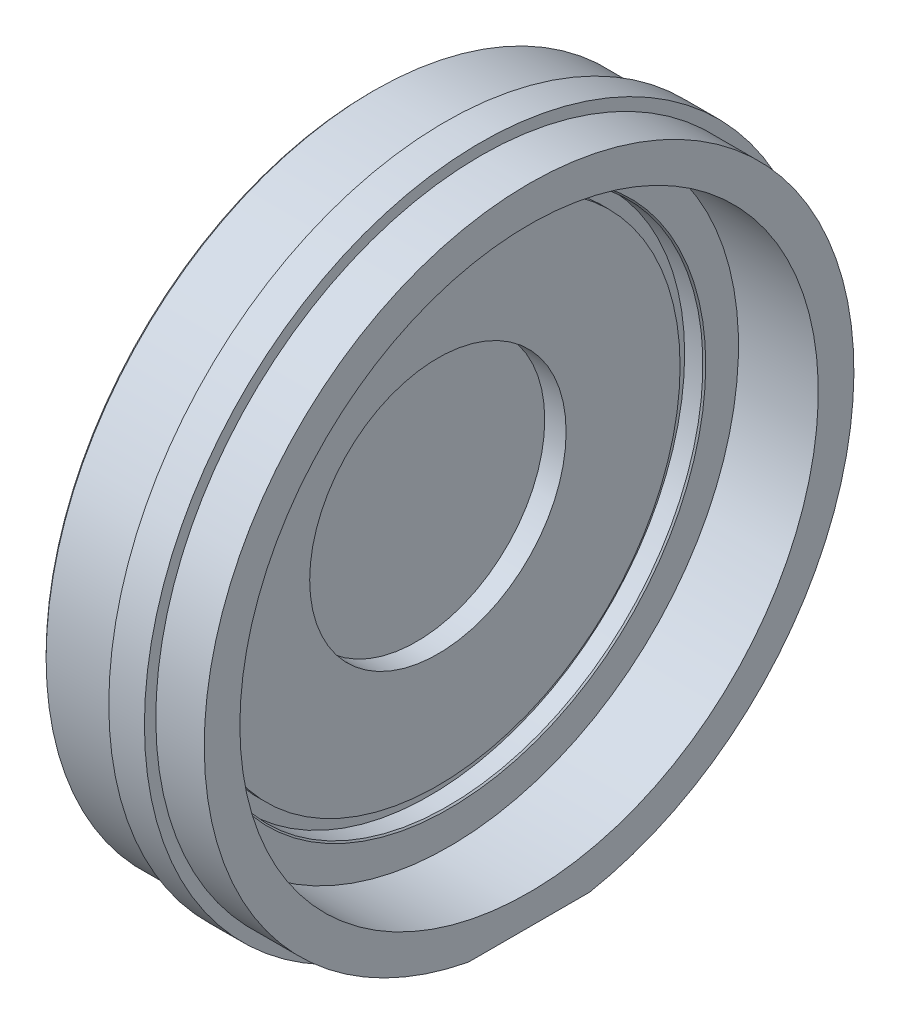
ISO-10303-21;
HEADER;
FILE_DESCRIPTION(('STEP AP214'),'2;1');
FILE_NAME('part.step','',(''),(''),'','','');
FILE_SCHEMA(('AUTOMOTIVE_DESIGN { 1 0 10303 214 1 1 1 1 }'));
ENDSEC;
DATA;
#1=APPLICATION_CONTEXT('core data for automotive mechanical design processes');
#2=APPLICATION_PROTOCOL_DEFINITION('international standard','automotive_design',2000,#1);
#3=PRODUCT_CONTEXT('',#1,'mechanical');
#4=PRODUCT('Part','Part','',(#3));
#5=PRODUCT_RELATED_PRODUCT_CATEGORY('part','',(#4));
#6=PRODUCT_DEFINITION_FORMATION('','',#4);
#7=PRODUCT_DEFINITION_CONTEXT('part definition',#1,'design');
#8=PRODUCT_DEFINITION('design','',#6,#7);
#9=PRODUCT_DEFINITION_SHAPE('','',#8);
#10=(LENGTH_UNIT() NAMED_UNIT(*) SI_UNIT(.MILLI.,.METRE.));
#11=(NAMED_UNIT(*) PLANE_ANGLE_UNIT() SI_UNIT($,.RADIAN.));
#12=(NAMED_UNIT(*) SI_UNIT($,.STERADIAN.) SOLID_ANGLE_UNIT());
#13=UNCERTAINTY_MEASURE_WITH_UNIT(LENGTH_MEASURE(1.E-05),#10,'distance_accuracy_value','');
#14=(GEOMETRIC_REPRESENTATION_CONTEXT(3) GLOBAL_UNCERTAINTY_ASSIGNED_CONTEXT((#13)) GLOBAL_UNIT_ASSIGNED_CONTEXT((#10,
#11,#12)) REPRESENTATION_CONTEXT('',''));
#15=CARTESIAN_POINT('',(0.,0.,0.));
#16=DIRECTION('',(0.,0.,1.));
#17=DIRECTION('',(1.,0.,0.));
#18=AXIS2_PLACEMENT_3D('',#15,#16,#17);
#19=CARTESIAN_POINT('',(2.49999999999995,115.,0.));
#20=DIRECTION('',(1.,0.,0.));
#21=DIRECTION('',(0.,0.,-1.));
#22=AXIS2_PLACEMENT_3D('',#19,#20,#21);
#23=PLANE('',#22);
#24=CARTESIAN_POINT('',(2.49999999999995,0.,0.));
#25=DIRECTION('',(-1.,0.,0.));
#26=DIRECTION('',(0.,0.,1.));
#27=AXIS2_PLACEMENT_3D('',#24,#25,#26);
#28=CIRCLE('',#27,115.);
#29=CARTESIAN_POINT('',(2.49999999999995,0.,115.));
#30=VERTEX_POINT('',#29);
#31=EDGE_CURVE('E115',#30,#30,#28,.T.);
#32=ORIENTED_EDGE('',*,*,#31,.F.);
#33=EDGE_LOOP('',(#32));
#34=FACE_BOUND('',#33,.T.);
#35=DIRECTION('',(0.,-1.,0.));
#36=VECTOR('',#35,1.);
#37=CARTESIAN_POINT('',(2.49999999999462,-115.5,-4.99999999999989));
#38=LINE('',#37,#36);
#39=CARTESIAN_POINT('',(2.49999999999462,-115.5,-4.99999999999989));
#40=VERTEX_POINT('',#39);
#41=CARTESIAN_POINT('',(2.49999999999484,-117.894020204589,-4.99999999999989));
#42=VERTEX_POINT('',#41);
#43=EDGE_CURVE('E276',#40,#42,#38,.T.);
#44=ORIENTED_EDGE('',*,*,#43,.F.);
#45=DIRECTION('',(0.,0.,1.));
#46=VECTOR('',#45,1.);
#47=CARTESIAN_POINT('',(2.49999999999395,-115.5,5.00000000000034));
#48=LINE('',#47,#46);
#49=CARTESIAN_POINT('',(2.49999999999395,-115.5,5.00000000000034));
#50=VERTEX_POINT('',#49);
#51=EDGE_CURVE('E279',#40,#50,#48,.T.);
#52=ORIENTED_EDGE('',*,*,#51,.T.);
#53=DIRECTION('',(0.,-1.,0.));
#54=VECTOR('',#53,1.);
#55=CARTESIAN_POINT('',(2.49999999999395,-115.5,5.00000000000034));
#56=LINE('',#55,#54);
#57=CARTESIAN_POINT('',(2.49999999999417,-117.894020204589,5.00000000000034));
#58=VERTEX_POINT('',#57);
#59=EDGE_CURVE('E284',#50,#58,#56,.T.);
#60=ORIENTED_EDGE('',*,*,#59,.T.);
#61=CARTESIAN_POINT('',(2.49999999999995,0.,0.));
#62=DIRECTION('',(-1.,0.,0.));
#63=DIRECTION('',(0.,0.,1.));
#64=AXIS2_PLACEMENT_3D('',#61,#62,#63);
#65=CIRCLE('',#64,118.);
#66=EDGE_CURVE('E107',#58,#42,#65,.T.);
#67=ORIENTED_EDGE('',*,*,#66,.T.);
#68=EDGE_LOOP('',(#44,#52,#60,#67));
#69=FACE_BOUND('',#68,.T.);
#70=ADVANCED_FACE('F14',(#34,#69),#23,.F.);
#71=CARTESIAN_POINT('',(0.,0.,0.));
#72=DIRECTION('',(-1.,0.,0.));
#73=DIRECTION('',(0.,0.,1.));
#74=AXIS2_PLACEMENT_3D('',#71,#72,#73);
#75=CYLINDRICAL_SURFACE('',#74,118.);
#76=CARTESIAN_POINT('',(14.9999999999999,0.,0.));
#77=DIRECTION('',(-1.,0.,0.));
#78=DIRECTION('',(0.,0.,1.));
#79=AXIS2_PLACEMENT_3D('',#76,#77,#78);
#80=CIRCLE('',#79,118.);
#81=CARTESIAN_POINT('',(14.9999999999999,0.,118.));
#82=VERTEX_POINT('',#81);
#83=EDGE_CURVE('E104',#82,#82,#80,.T.);
#84=ORIENTED_EDGE('',*,*,#83,.T.);
#85=EDGE_LOOP('',(#84));
#86=FACE_BOUND('',#85,.T.);
#87=DIRECTION('',(-1.,0.,0.));
#88=VECTOR('',#87,1.);
#89=CARTESIAN_POINT('',(-5.10702591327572E-12,-117.894020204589,-4.99999999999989));
#90=LINE('',#89,#88);
#91=CARTESIAN_POINT('',(3.49999999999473,-117.894020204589,-4.99999999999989));
#92=VERTEX_POINT('',#91);
#93=EDGE_CURVE('E133',#42,#92,#90,.F.);
#94=ORIENTED_EDGE('',*,*,#93,.F.);
#95=ORIENTED_EDGE('',*,*,#66,.F.);
#96=DIRECTION('',(-1.,0.,0.));
#97=VECTOR('',#96,1.);
#98=CARTESIAN_POINT('',(-5.77315972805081E-12,-117.894020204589,5.00000000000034));
#99=LINE('',#98,#97);
#100=CARTESIAN_POINT('',(3.49999999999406,-117.894020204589,5.00000000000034));
#101=VERTEX_POINT('',#100);
#102=EDGE_CURVE('E124',#101,#58,#99,.T.);
#103=ORIENTED_EDGE('',*,*,#102,.F.);
#104=CARTESIAN_POINT('',(3.49999999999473,-117.894020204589,-4.99999999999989));
#105=CARTESIAN_POINT('',(3.64055955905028,-117.894017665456,-5.00001518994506));
#106=CARTESIAN_POINT('',(3.78111685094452,-117.894271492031,-4.99407354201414));
#107=CARTESIAN_POINT('',(4.0612246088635,-117.895273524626,-4.97038634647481));
#108=CARTESIAN_POINT('',(4.20077512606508,-117.896021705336,-4.9526414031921));
#109=CARTESIAN_POINT('',(4.47777916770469,-117.897993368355,-4.90547482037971));
#110=CARTESIAN_POINT('',(4.61523416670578,-117.899216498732,-4.87606182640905));
#111=CARTESIAN_POINT('',(4.88717517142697,-117.90210252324,-4.80577413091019));
#112=CARTESIAN_POINT('',(5.02166121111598,-117.903765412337,-4.76489956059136));
#113=CARTESIAN_POINT('',(5.28674693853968,-117.907484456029,-4.67196620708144));
#114=CARTESIAN_POINT('',(5.41734556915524,-117.909540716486,-4.61990441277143));
#115=CARTESIAN_POINT('',(5.67373937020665,-117.913988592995,-4.50495306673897));
#116=CARTESIAN_POINT('',(5.79953274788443,-117.916380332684,-4.44205952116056));
#117=CARTESIAN_POINT('',(6.04530439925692,-117.921429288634,-4.30594328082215));
#118=CARTESIAN_POINT('',(6.16528584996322,-117.92408635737,-4.23272631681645));
#119=CARTESIAN_POINT('',(6.39870137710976,-117.929592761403,-4.07642804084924));
#120=CARTESIAN_POINT('',(6.51213301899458,-117.93244216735,-3.99334309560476));
#121=CARTESIAN_POINT('',(6.7316204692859,-117.938252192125,-3.81790151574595));
#122=CARTESIAN_POINT('',(6.8376747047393,-117.941212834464,-3.72554291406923));
#123=CARTESIAN_POINT('',(7.04166682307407,-117.947161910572,-3.532188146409));
#124=CARTESIAN_POINT('',(7.13960169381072,-117.950150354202,-3.43118880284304));
#125=CARTESIAN_POINT('',(7.32659610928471,-117.956068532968,-3.22132127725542));
#126=CARTESIAN_POINT('',(7.41565757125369,-117.958998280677,-3.11245480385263));
#127=CARTESIAN_POINT('',(7.58432830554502,-117.964717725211,-2.8875640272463));
#128=CARTESIAN_POINT('',(7.6639340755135,-117.967507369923,-2.77153709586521));
#129=CARTESIAN_POINT('',(7.81308651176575,-117.972866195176,-2.5331892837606));
#130=CARTESIAN_POINT('',(7.88263353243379,-117.975435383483,-2.41086862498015));
#131=CARTESIAN_POINT('',(8.01120050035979,-117.980281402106,-2.16075211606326));
#132=CARTESIAN_POINT('',(8.07021655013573,-117.982558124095,-2.0329542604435));
#133=CARTESIAN_POINT('',(8.1772453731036,-117.986752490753,-1.7728896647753));
#134=CARTESIAN_POINT('',(8.22526292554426,-117.988670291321,-1.64062489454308));
#135=CARTESIAN_POINT('',(8.31000119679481,-117.992094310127,-1.37246954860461));
#136=CARTESIAN_POINT('',(8.34671775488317,-117.993600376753,-1.23657765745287));
#137=CARTESIAN_POINT('',(8.40853534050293,-117.996155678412,-0.962294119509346));
#138=CARTESIAN_POINT('',(8.43364731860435,-117.997205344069,-0.823904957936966));
#139=CARTESIAN_POINT('',(8.47214463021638,-117.998821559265,-0.545505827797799));
#140=CARTESIAN_POINT('',(8.48552588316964,-117.999387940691,-0.405495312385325));
#141=CARTESIAN_POINT('',(8.50783931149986,-118.000330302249,0.0154889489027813));
#142=CARTESIAN_POINT('',(8.49900634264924,-117.999952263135,0.297705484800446));
#143=CARTESIAN_POINT('',(8.4504214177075,-117.997909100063,0.716377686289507));
#144=CARTESIAN_POINT('',(8.42832903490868,-117.996981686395,0.855187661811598));
#145=CARTESIAN_POINT('',(8.37254910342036,-117.99466480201,1.13045776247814));
#146=CARTESIAN_POINT('',(8.33886558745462,-117.993275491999,1.26691868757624));
#147=CARTESIAN_POINT('',(8.26012180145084,-117.990072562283,1.53655079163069));
#148=CARTESIAN_POINT('',(8.21505749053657,-117.988258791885,1.66972078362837));
#149=CARTESIAN_POINT('',(8.1138996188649,-117.984259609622,1.93174548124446));
#150=CARTESIAN_POINT('',(8.05781011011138,-117.982074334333,2.06060175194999));
#151=CARTESIAN_POINT('',(7.93494577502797,-117.977391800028,2.31322284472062));
#152=CARTESIAN_POINT('',(7.8681633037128,-117.974894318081,2.43698394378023));
#153=CARTESIAN_POINT('',(7.72444364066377,-117.969660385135,2.67839540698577));
#154=CARTESIAN_POINT('',(7.64751019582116,-117.966924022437,2.7960480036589));
#155=CARTESIAN_POINT('',(7.48398911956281,-117.961288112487,3.02449483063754));
#156=CARTESIAN_POINT('',(7.39739836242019,-117.958388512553,3.13528682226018));
#157=CARTESIAN_POINT('',(7.21523107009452,-117.952510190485,3.34914631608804));
#158=CARTESIAN_POINT('',(7.11965785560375,-117.949531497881,3.45221664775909));
#159=CARTESIAN_POINT('',(6.9200736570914,-117.943575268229,3.65004920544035));
#160=CARTESIAN_POINT('',(6.81605414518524,-117.940597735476,3.74480282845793));
#161=CARTESIAN_POINT('',(6.60044039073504,-117.934732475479,3.92517747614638));
#162=CARTESIAN_POINT('',(6.48884895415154,-117.93184471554,4.01080185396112));
#163=CARTESIAN_POINT('',(6.25876941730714,-117.926237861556,4.1724055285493));
#164=CARTESIAN_POINT('',(6.140276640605,-117.923518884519,4.24837817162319));
#165=CARTESIAN_POINT('',(5.89735057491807,-117.918330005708,4.39004251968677));
#166=CARTESIAN_POINT('',(5.77291949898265,-117.915860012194,4.45573801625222));
#167=CARTESIAN_POINT('',(5.51883271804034,-117.911235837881,4.57647449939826));
#168=CARTESIAN_POINT('',(5.3891719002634,-117.909081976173,4.63150473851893));
#169=CARTESIAN_POINT('',(5.12571463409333,-117.905155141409,4.73041668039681));
#170=CARTESIAN_POINT('',(4.99191976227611,-117.903382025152,4.77430257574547));
#171=CARTESIAN_POINT('',(4.72125409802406,-117.900267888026,4.85059678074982));
#172=CARTESIAN_POINT('',(4.58438684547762,-117.898926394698,4.88301764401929));
#173=CARTESIAN_POINT('',(4.30845867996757,-117.896711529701,4.93620512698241));
#174=CARTESIAN_POINT('',(4.16939887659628,-117.895837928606,4.95697745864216));
#175=CARTESIAN_POINT('',(3.94169922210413,-117.894814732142,4.98123925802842));
#176=CARTESIAN_POINT('',(3.85342307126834,-117.894516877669,4.98827898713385));
#177=CARTESIAN_POINT('',(3.67676766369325,-117.894119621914,4.9976560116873));
#178=CARTESIAN_POINT('',(3.5883888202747,-117.894019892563,5.00000108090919));
#179=CARTESIAN_POINT('',(3.49999999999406,-117.894020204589,5.00000000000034));
#180=B_SPLINE_CURVE_WITH_KNOTS('',3,(#104,#105,#106,#107,#108,#109,#110,#111,#112,#113,#114,
#115,#116,#117,#118,#119,#120,#121,#122,#123,#124,#125,#126,#127,#128,#129,#130,#131,#132,#133,
#134,#135,#136,#137,#138,#139,#140,#141,#142,#143,#144,#145,#146,#147,#148,#149,#150,#151,#152,
#153,#154,#155,#156,#157,#158,#159,#160,#161,#162,#163,#164,#165,#166,#167,#168,#169,#170,#171,
#172,#173,#174,#175,#176,#177,#178,#179),.UNSPECIFIED.,.F.,.F.,(4,2,2,2,2,2,2,2,2,2,2,2,2,2,2,2,
2,2,2,2,2,2,2,2,2,2,2,2,2,2,2,2,2,2,2,2,2,4),(0.,0.421549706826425,0.84307783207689,
1.26429420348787,1.6855057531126,2.1068308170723,2.52831156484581,2.94955925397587,
3.37096252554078,3.79245537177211,4.21410389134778,4.63566110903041,5.05737398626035,
5.47907200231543,5.90092576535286,6.32259586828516,6.74442103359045,7.16584732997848,
7.58742016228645,8.42968456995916,8.85098972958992,9.27214845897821,9.69345693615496,
10.1146108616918,10.5360672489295,10.9573685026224,11.3788065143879,11.8000893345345,
12.2218029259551,12.6433610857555,13.065208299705,13.4868995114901,13.9090134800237,
14.3309684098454,14.7524598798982,15.1737444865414,15.4393000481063,15.7044155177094),.UNSPECIFIED.);
#181=EDGE_CURVE('E126',#92,#101,#180,.T.);
#182=ORIENTED_EDGE('',*,*,#181,.F.);
#183=EDGE_LOOP('',(#94,#95,#103,#182));
#184=FACE_BOUND('',#183,.T.);
#185=ADVANCED_FACE('F135',(#86,#184),#75,.T.);
#186=CARTESIAN_POINT('',(-23.5000000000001,115.,-3.06421554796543E-11));
#187=DIRECTION('',(1.,0.,0.));
#188=DIRECTION('',(0.,0.,-1.));
#189=AXIS2_PLACEMENT_3D('',#186,#187,#188);
#190=PLANE('',#189);
#191=CARTESIAN_POINT('',(-23.5000000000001,0.,0.));
#192=DIRECTION('',(1.,0.,0.));
#193=DIRECTION('',(0.,0.,-1.));
#194=AXIS2_PLACEMENT_3D('',#191,#192,#193);
#195=CIRCLE('',#194,114.);
#196=CARTESIAN_POINT('',(-23.5000000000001,0.,-114.));
#197=VERTEX_POINT('',#196);
#198=EDGE_CURVE('E390',#197,#197,#195,.F.);
#199=ORIENTED_EDGE('',*,*,#198,.T.);
#200=EDGE_LOOP('',(#199));
#201=FACE_BOUND('',#200,.T.);
#202=CARTESIAN_POINT('',(-23.5000000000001,99.9999999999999,-3.06421554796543E-11));
#203=DIRECTION('',(-1.,0.,0.));
#204=DIRECTION('',(0.,0.,1.));
#205=AXIS2_PLACEMENT_3D('',#202,#203,#204);
#206=CIRCLE('',#205,5.1);
#207=CARTESIAN_POINT('',(-23.5000000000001,99.9999999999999,5.09999999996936));
#208=VERTEX_POINT('',#207);
#209=EDGE_CURVE('E294',#208,#208,#206,.T.);
#210=ORIENTED_EDGE('',*,*,#209,.F.);
#211=EDGE_LOOP('',(#210));
#212=FACE_BOUND('',#211,.T.);
#213=CARTESIAN_POINT('',(-23.4999999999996,49.9999999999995,86.6025403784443));
#214=DIRECTION('',(-1.,0.,0.));
#215=DIRECTION('',(0.,0.,1.));
#216=AXIS2_PLACEMENT_3D('',#213,#214,#215);
#217=CIRCLE('',#216,5.1);
#218=CARTESIAN_POINT('',(-23.4999999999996,49.9999999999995,91.7025403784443));
#219=VERTEX_POINT('',#218);
#220=EDGE_CURVE('E300',#219,#219,#217,.T.);
#221=ORIENTED_EDGE('',*,*,#220,.F.);
#222=EDGE_LOOP('',(#221));
#223=FACE_BOUND('',#222,.T.);
#224=CARTESIAN_POINT('',(-23.5000000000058,-50.0000000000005,86.6025403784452));
#225=DIRECTION('',(-1.,0.,0.));
#226=DIRECTION('',(0.,0.,1.));
#227=AXIS2_PLACEMENT_3D('',#224,#225,#226);
#228=CIRCLE('',#227,5.1);
#229=CARTESIAN_POINT('',(-23.5000000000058,-50.0000000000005,91.7025403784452));
#230=VERTEX_POINT('',#229);
#231=EDGE_CURVE('E306',#230,#230,#228,.T.);
#232=ORIENTED_EDGE('',*,*,#231,.F.);
#233=EDGE_LOOP('',(#232));
#234=FACE_BOUND('',#233,.T.);
#235=CARTESIAN_POINT('',(-23.4999999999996,50.,-86.6025403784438));
#236=DIRECTION('',(-1.,0.,0.));
#237=DIRECTION('',(0.,0.,1.));
#238=AXIS2_PLACEMENT_3D('',#235,#236,#237);
#239=CIRCLE('',#238,5.1);
#240=CARTESIAN_POINT('',(-23.4999999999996,50.,-81.5025403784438));
#241=VERTEX_POINT('',#240);
#242=EDGE_CURVE('E312',#241,#241,#239,.T.);
#243=ORIENTED_EDGE('',*,*,#242,.F.);
#244=EDGE_LOOP('',(#243));
#245=FACE_BOUND('',#244,.T.);
#246=CARTESIAN_POINT('',(-23.5000000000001,-50.,-86.6025403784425));
#247=DIRECTION('',(-1.,0.,0.));
#248=DIRECTION('',(0.,0.,1.));
#249=AXIS2_PLACEMENT_3D('',#246,#247,#248);
#250=CIRCLE('',#249,5.1);
#251=CARTESIAN_POINT('',(-23.5000000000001,-50.,-81.5025403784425));
#252=VERTEX_POINT('',#251);
#253=EDGE_CURVE('E318',#252,#252,#250,.T.);
#254=ORIENTED_EDGE('',*,*,#253,.F.);
#255=EDGE_LOOP('',(#254));
#256=FACE_BOUND('',#255,.T.);
#257=CARTESIAN_POINT('',(-23.5000000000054,-100.,1.33226762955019E-12));
#258=DIRECTION('',(-1.,0.,0.));
#259=DIRECTION('',(0.,0.,1.));
#260=AXIS2_PLACEMENT_3D('',#257,#258,#259);
#261=CIRCLE('',#260,5.1);
#262=CARTESIAN_POINT('',(-23.5000000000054,-100.,5.10000000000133));
#263=VERTEX_POINT('',#262);
#264=EDGE_CURVE('E324',#263,#263,#261,.T.);
#265=ORIENTED_EDGE('',*,*,#264,.F.);
#266=EDGE_LOOP('',(#265));
#267=FACE_BOUND('',#266,.T.);
#268=CARTESIAN_POINT('',(-23.5000000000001,-3.4781205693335E-13,100.));
#269=DIRECTION('',(-1.,0.,0.));
#270=DIRECTION('',(0.,0.,1.));
#271=AXIS2_PLACEMENT_3D('',#268,#269,#270);
#272=CIRCLE('',#271,7.);
#273=CARTESIAN_POINT('',(-23.5000000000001,-3.4781205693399E-13,107.));
#274=VERTEX_POINT('',#273);
#275=EDGE_CURVE('E333',#274,#274,#272,.T.);
#276=ORIENTED_EDGE('',*,*,#275,.F.);
#277=EDGE_LOOP('',(#276));
#278=FACE_BOUND('',#277,.T.);
#279=CARTESIAN_POINT('',(-23.5000000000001,0.,0.));
#280=DIRECTION('',(1.,0.,0.));
#281=DIRECTION('',(0.,0.,-1.));
#282=AXIS2_PLACEMENT_3D('',#279,#280,#281);
#283=CIRCLE('',#282,63.5);
#284=CARTESIAN_POINT('',(-23.5000000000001,0.,-63.5));
#285=VERTEX_POINT('',#284);
#286=EDGE_CURVE('E121',#285,#285,#283,.T.);
#287=ORIENTED_EDGE('',*,*,#286,.T.);
#288=EDGE_LOOP('',(#287));
#289=FACE_BOUND('',#288,.T.);
#290=ADVANCED_FACE('F16',(#201,#212,#223,#234,#245,#256,#267,#278,#289),#190,.F.);
#291=CARTESIAN_POINT('',(0.,0.,0.));
#292=DIRECTION('',(-1.,0.,0.));
#293=DIRECTION('',(0.,0.,1.));
#294=AXIS2_PLACEMENT_3D('',#291,#292,#293);
#295=CYLINDRICAL_SURFACE('',#294,115.);
#296=CARTESIAN_POINT('',(-22.5,0.,0.));
#297=DIRECTION('',(1.,0.,0.));
#298=DIRECTION('',(0.,0.,-1.));
#299=AXIS2_PLACEMENT_3D('',#296,#297,#298);
#300=CIRCLE('',#299,115.);
#301=CARTESIAN_POINT('',(-22.5,0.,-115.));
#302=VERTEX_POINT('',#301);
#303=EDGE_CURVE('E392',#302,#302,#300,.T.);
#304=ORIENTED_EDGE('',*,*,#303,.T.);
#305=EDGE_LOOP('',(#304));
#306=FACE_BOUND('',#305,.T.);
#307=ORIENTED_EDGE('',*,*,#31,.T.);
#308=EDGE_LOOP('',(#307));
#309=FACE_BOUND('',#308,.T.);
#310=ADVANCED_FACE('F258',(#306,#309),#295,.T.);
#311=CARTESIAN_POINT('',(15.0000000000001,118.,0.));
#312=DIRECTION('',(-1.,0.,0.));
#313=DIRECTION('',(0.,0.,1.));
#314=AXIS2_PLACEMENT_3D('',#311,#312,#313);
#315=PLANE('',#314);
#316=ORIENTED_EDGE('',*,*,#83,.F.);
#317=EDGE_LOOP('',(#316));
#318=FACE_BOUND('',#317,.T.);
#319=DIRECTION('',(0.,0.,1.));
#320=VECTOR('',#319,1.);
#321=CARTESIAN_POINT('',(15.0000000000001,-111.999999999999,25.0000000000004));
#322=LINE('',#321,#320);
#323=CARTESIAN_POINT('',(15.0000000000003,-111.999999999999,-21.2602916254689));
#324=VERTEX_POINT('',#323);
#325=CARTESIAN_POINT('',(15.0000000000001,-112.,21.2602916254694));
#326=VERTEX_POINT('',#325);
#327=EDGE_CURVE('E86',#324,#326,#322,.T.);
#328=ORIENTED_EDGE('',*,*,#327,.T.);
#329=CARTESIAN_POINT('',(14.9999999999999,0.,0.));
#330=DIRECTION('',(-1.,0.,0.));
#331=DIRECTION('',(0.,0.,1.));
#332=AXIS2_PLACEMENT_3D('',#329,#330,#331);
#333=CIRCLE('',#332,114.);
#334=EDGE_CURVE('E98',#326,#324,#333,.T.);
#335=ORIENTED_EDGE('',*,*,#334,.T.);
#336=EDGE_LOOP('',(#328,#335));
#337=FACE_BOUND('',#336,.T.);
#338=ADVANCED_FACE('F103',(#318,#337),#315,.F.);
#339=CARTESIAN_POINT('',(0.,0.,0.));
#340=DIRECTION('',(-1.,0.,0.));
#341=DIRECTION('',(0.,0.,1.));
#342=AXIS2_PLACEMENT_3D('',#339,#340,#341);
#343=CYLINDRICAL_SURFACE('',#342,114.);
#344=CARTESIAN_POINT('',(32.,0.,0.));
#345=DIRECTION('',(-1.,0.,0.));
#346=DIRECTION('',(0.,0.,1.));
#347=AXIS2_PLACEMENT_3D('',#344,#345,#346);
#348=CIRCLE('',#347,114.);
#349=CARTESIAN_POINT('',(32.,-112.,21.2602916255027));
#350=VERTEX_POINT('',#349);
#351=CARTESIAN_POINT('',(32.0000000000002,-111.999999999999,-21.2602916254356));
#352=VERTEX_POINT('',#351);
#353=EDGE_CURVE('E100',#350,#352,#348,.T.);
#354=ORIENTED_EDGE('',*,*,#353,.T.);
#355=DIRECTION('',(-1.,0.,0.));
#356=VECTOR('',#355,1.);
#357=CARTESIAN_POINT('',(4.44089209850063E-13,-112.,-21.2602916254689));
#358=LINE('',#357,#356);
#359=EDGE_CURVE('E29',#352,#324,#358,.T.);
#360=ORIENTED_EDGE('',*,*,#359,.T.);
#361=ORIENTED_EDGE('',*,*,#334,.F.);
#362=DIRECTION('',(-1.,0.,0.));
#363=VECTOR('',#362,1.);
#364=CARTESIAN_POINT('',(0.,-112.,21.2602916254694));
#365=LINE('',#364,#363);
#366=EDGE_CURVE('E89',#326,#350,#365,.F.);
#367=ORIENTED_EDGE('',*,*,#366,.T.);
#368=EDGE_LOOP('',(#354,#360,#361,#367));
#369=FACE_BOUND('',#368,.T.);
#370=ADVANCED_FACE('F97',(#369),#343,.T.);
#371=CARTESIAN_POINT('',(32.,101.500000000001,0.));
#372=DIRECTION('',(-1.,0.,0.));
#373=DIRECTION('',(0.,0.,1.));
#374=AXIS2_PLACEMENT_3D('',#371,#372,#373);
#375=PLANE('',#374);
#376=ORIENTED_EDGE('',*,*,#353,.F.);
#377=DIRECTION('',(0.,0.,-1.));
#378=VECTOR('',#377,1.);
#379=CARTESIAN_POINT('',(31.9999999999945,-111.999999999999,3.37507799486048E-11));
#380=LINE('',#379,#378);
#381=EDGE_CURVE('E396',#350,#352,#380,.T.);
#382=ORIENTED_EDGE('',*,*,#381,.T.);
#383=EDGE_LOOP('',(#376,#382));
#384=FACE_BOUND('',#383,.T.);
#385=CARTESIAN_POINT('',(32.,0.,0.));
#386=DIRECTION('',(-1.,0.,0.));
#387=DIRECTION('',(0.,0.,1.));
#388=AXIS2_PLACEMENT_3D('',#385,#386,#387);
#389=CIRCLE('',#388,101.5);
#390=CARTESIAN_POINT('',(32.,0.,101.5));
#391=VERTEX_POINT('',#390);
#392=EDGE_CURVE('E109',#391,#391,#389,.T.);
#393=ORIENTED_EDGE('',*,*,#392,.T.);
#394=EDGE_LOOP('',(#393));
#395=FACE_BOUND('',#394,.T.);
#396=ADVANCED_FACE('F251',(#384,#395),#375,.F.);
#397=CARTESIAN_POINT('',(0.,0.,0.));
#398=DIRECTION('',(-1.,0.,0.));
#399=DIRECTION('',(0.,0.,1.));
#400=AXIS2_PLACEMENT_3D('',#397,#398,#399);
#401=CYLINDRICAL_SURFACE('',#400,101.5);
#402=ORIENTED_EDGE('',*,*,#392,.F.);
#403=EDGE_LOOP('',(#402));
#404=FACE_BOUND('',#403,.T.);
#405=CARTESIAN_POINT('',(4.,0.,0.));
#406=DIRECTION('',(-1.,0.,0.));
#407=DIRECTION('',(0.,0.,1.));
#408=AXIS2_PLACEMENT_3D('',#405,#406,#407);
#409=CIRCLE('',#408,101.5);
#410=CARTESIAN_POINT('',(4.,0.,101.5));
#411=VERTEX_POINT('',#410);
#412=EDGE_CURVE('E351',#411,#411,#409,.T.);
#413=ORIENTED_EDGE('',*,*,#412,.T.);
#414=EDGE_LOOP('',(#413));
#415=FACE_BOUND('',#414,.T.);
#416=ADVANCED_FACE('F247',(#404,#415),#401,.F.);
#417=CARTESIAN_POINT('',(4.,89.5,3.37507799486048E-11));
#418=DIRECTION('',(-1.,0.,0.));
#419=DIRECTION('',(0.,0.,1.));
#420=AXIS2_PLACEMENT_3D('',#417,#418,#419);
#421=PLANE('',#420);
#422=CARTESIAN_POINT('',(4.,0.,0.));
#423=DIRECTION('',(-1.,0.,0.));
#424=DIRECTION('',(0.,0.,1.));
#425=AXIS2_PLACEMENT_3D('',#422,#423,#424);
#426=CIRCLE('',#425,90.);
#427=CARTESIAN_POINT('',(4.,0.,90.));
#428=VERTEX_POINT('',#427);
#429=EDGE_CURVE('E22',#428,#428,#426,.T.);
#430=ORIENTED_EDGE('',*,*,#429,.T.);
#431=EDGE_LOOP('',(#430));
#432=FACE_BOUND('',#431,.T.);
#433=ORIENTED_EDGE('',*,*,#412,.F.);
#434=EDGE_LOOP('',(#433));
#435=FACE_BOUND('',#434,.T.);
#436=ADVANCED_FACE('F243',(#432,#435),#421,.F.);
#437=CARTESIAN_POINT('',(0.,0.,0.));
#438=DIRECTION('',(-1.,0.,0.));
#439=DIRECTION('',(0.,0.,1.));
#440=AXIS2_PLACEMENT_3D('',#437,#438,#439);
#441=CYLINDRICAL_SURFACE('',#440,89.5);
#442=CARTESIAN_POINT('',(3.50000000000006,0.,0.));
#443=DIRECTION('',(-1.,0.,0.));
#444=DIRECTION('',(0.,0.,1.));
#445=AXIS2_PLACEMENT_3D('',#442,#443,#444);
#446=CIRCLE('',#445,89.5);
#447=CARTESIAN_POINT('',(3.50000000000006,0.,89.5));
#448=VERTEX_POINT('',#447);
#449=EDGE_CURVE('E9',#448,#448,#446,.F.);
#450=ORIENTED_EDGE('',*,*,#449,.T.);
#451=EDGE_LOOP('',(#450));
#452=FACE_BOUND('',#451,.T.);
#453=CARTESIAN_POINT('',(-2.8999999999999,0.,0.));
#454=DIRECTION('',(1.,0.,0.));
#455=DIRECTION('',(0.,0.,-1.));
#456=AXIS2_PLACEMENT_3D('',#453,#454,#455);
#457=CIRCLE('',#456,89.5);
#458=CARTESIAN_POINT('',(-2.8999999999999,0.,-89.5));
#459=VERTEX_POINT('',#458);
#460=EDGE_CURVE('E93',#459,#459,#457,.T.);
#461=ORIENTED_EDGE('',*,*,#460,.F.);
#462=EDGE_LOOP('',(#461));
#463=FACE_BOUND('',#462,.T.);
#464=ADVANCED_FACE('F226',(#452,#463),#441,.F.);
#465=CARTESIAN_POINT('',(-12.9999999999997,49.9999999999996,0.));
#466=DIRECTION('',(1.,0.,0.));
#467=DIRECTION('',(0.,0.,-1.));
#468=AXIS2_PLACEMENT_3D('',#465,#466,#467);
#469=PLANE('',#468);
#470=CARTESIAN_POINT('',(-12.9999999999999,0.,0.));
#471=DIRECTION('',(-1.,0.,0.));
#472=DIRECTION('',(0.,0.,1.));
#473=AXIS2_PLACEMENT_3D('',#470,#471,#472);
#474=CIRCLE('',#473,50.);
#475=CARTESIAN_POINT('',(-12.9999999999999,0.,50.));
#476=VERTEX_POINT('',#475);
#477=EDGE_CURVE('E342',#476,#476,#474,.T.);
#478=ORIENTED_EDGE('',*,*,#477,.T.);
#479=EDGE_LOOP('',(#478));
#480=FACE_BOUND('',#479,.T.);
#481=ADVANCED_FACE('F222',(#480),#469,.F.);
#482=CARTESIAN_POINT('',(0.,0.,0.));
#483=DIRECTION('',(-1.,0.,0.));
#484=DIRECTION('',(0.,0.,1.));
#485=AXIS2_PLACEMENT_3D('',#482,#483,#484);
#486=CYLINDRICAL_SURFACE('',#485,50.);
#487=ORIENTED_EDGE('',*,*,#477,.F.);
#488=EDGE_LOOP('',(#487));
#489=FACE_BOUND('',#488,.T.);
#490=CARTESIAN_POINT('',(-13.5000000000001,0.,0.));
#491=DIRECTION('',(-1.,0.,0.));
#492=DIRECTION('',(0.,0.,1.));
#493=AXIS2_PLACEMENT_3D('',#490,#491,#492);
#494=CIRCLE('',#493,50.);
#495=CARTESIAN_POINT('',(-13.5000000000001,0.,50.));
#496=VERTEX_POINT('',#495);
#497=EDGE_CURVE('E339',#496,#496,#494,.T.);
#498=ORIENTED_EDGE('',*,*,#497,.T.);
#499=EDGE_LOOP('',(#498));
#500=FACE_BOUND('',#499,.T.);
#501=ADVANCED_FACE('F218',(#489,#500),#486,.F.);
#502=CARTESIAN_POINT('',(-13.4999999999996,62.4999999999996,1.33226762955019E-12));
#503=DIRECTION('',(1.,0.,0.));
#504=DIRECTION('',(0.,0.,-1.));
#505=AXIS2_PLACEMENT_3D('',#502,#503,#504);
#506=PLANE('',#505);
#507=ORIENTED_EDGE('',*,*,#497,.F.);
#508=EDGE_LOOP('',(#507));
#509=FACE_BOUND('',#508,.T.);
#510=CARTESIAN_POINT('',(-13.5000000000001,0.,0.));
#511=DIRECTION('',(-1.,0.,0.));
#512=DIRECTION('',(0.,0.,1.));
#513=AXIS2_PLACEMENT_3D('',#510,#511,#512);
#514=CIRCLE('',#513,62.5);
#515=CARTESIAN_POINT('',(-13.5000000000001,0.,62.5));
#516=VERTEX_POINT('',#515);
#517=EDGE_CURVE('E336',#516,#516,#514,.T.);
#518=ORIENTED_EDGE('',*,*,#517,.T.);
#519=EDGE_LOOP('',(#518));
#520=FACE_BOUND('',#519,.T.);
#521=ADVANCED_FACE('F214',(#509,#520),#506,.F.);
#522=CARTESIAN_POINT('',(0.,0.,0.));
#523=DIRECTION('',(-1.,0.,0.));
#524=DIRECTION('',(0.,0.,1.));
#525=AXIS2_PLACEMENT_3D('',#522,#523,#524);
#526=CYLINDRICAL_SURFACE('',#525,62.5);
#527=CARTESIAN_POINT('',(-22.5,0.,0.));
#528=DIRECTION('',(1.,0.,0.));
#529=DIRECTION('',(0.,0.,-1.));
#530=AXIS2_PLACEMENT_3D('',#527,#528,#529);
#531=CIRCLE('',#530,62.5);
#532=CARTESIAN_POINT('',(-22.5,0.,-62.5));
#533=VERTEX_POINT('',#532);
#534=EDGE_CURVE('E118',#533,#533,#531,.F.);
#535=ORIENTED_EDGE('',*,*,#534,.T.);
#536=EDGE_LOOP('',(#535));
#537=FACE_BOUND('',#536,.T.);
#538=ORIENTED_EDGE('',*,*,#517,.F.);
#539=EDGE_LOOP('',(#538));
#540=FACE_BOUND('',#539,.T.);
#541=ADVANCED_FACE('F210',(#537,#540),#526,.F.);
#542=CARTESIAN_POINT('',(-22.5,0.,0.));
#543=DIRECTION('',(-1.,0.,0.));
#544=DIRECTION('',(0.,0.,1.));
#545=AXIS2_PLACEMENT_3D('',#542,#543,#544);
#546=CONICAL_SURFACE('',#545,62.5,0.785398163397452);
#547=ORIENTED_EDGE('',*,*,#286,.F.);
#548=EDGE_LOOP('',(#547));
#549=FACE_BOUND('',#548,.T.);
#550=ORIENTED_EDGE('',*,*,#534,.F.);
#551=EDGE_LOOP('',(#550));
#552=FACE_BOUND('',#551,.T.);
#553=ADVANCED_FACE('F206',(#549,#552),#546,.F.);
#554=CARTESIAN_POINT('',(-23.5000000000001,-3.4781205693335E-13,100.));
#555=DIRECTION('',(-1.,0.,0.));
#556=DIRECTION('',(0.,0.,1.));
#557=AXIS2_PLACEMENT_3D('',#554,#555,#556);
#558=CONICAL_SURFACE('',#557,7.,0.785398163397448);
#559=CARTESIAN_POINT('',(-22.5,-3.49113099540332E-13,100.));
#560=DIRECTION('',(-1.,0.,0.));
#561=DIRECTION('',(0.,0.,1.));
#562=AXIS2_PLACEMENT_3D('',#559,#560,#561);
#563=CIRCLE('',#562,6.);
#564=CARTESIAN_POINT('',(-22.5,-3.49113099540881E-13,106.));
#565=VERTEX_POINT('',#564);
#566=EDGE_CURVE('E330',#565,#565,#563,.T.);
#567=ORIENTED_EDGE('',*,*,#566,.F.);
#568=EDGE_LOOP('',(#567));
#569=FACE_BOUND('',#568,.T.);
#570=ORIENTED_EDGE('',*,*,#275,.T.);
#571=EDGE_LOOP('',(#570));
#572=FACE_BOUND('',#571,.T.);
#573=ADVANCED_FACE('F202',(#569,#572),#558,.F.);
#574=CARTESIAN_POINT('',(-23.5000000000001,-3.4781205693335E-13,100.));
#575=DIRECTION('',(-1.,0.,0.));
#576=DIRECTION('',(0.,0.,1.));
#577=AXIS2_PLACEMENT_3D('',#574,#575,#576);
#578=CYLINDRICAL_SURFACE('',#577,6.);
#579=CARTESIAN_POINT('',(-3.50000000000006,-3.51715184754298E-13,100.));
#580=DIRECTION('',(-1.,0.,0.));
#581=DIRECTION('',(0.,0.,1.));
#582=AXIS2_PLACEMENT_3D('',#579,#580,#581);
#583=CIRCLE('',#582,6.);
#584=CARTESIAN_POINT('',(-3.50000000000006,-3.51715184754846E-13,106.));
#585=VERTEX_POINT('',#584);
#586=EDGE_CURVE('E327',#585,#585,#583,.T.);
#587=ORIENTED_EDGE('',*,*,#586,.F.);
#588=EDGE_LOOP('',(#587));
#589=FACE_BOUND('',#588,.T.);
#590=ORIENTED_EDGE('',*,*,#566,.T.);
#591=EDGE_LOOP('',(#590));
#592=FACE_BOUND('',#591,.T.);
#593=ADVANCED_FACE('F198',(#589,#592),#578,.F.);
#594=CARTESIAN_POINT('',(-3.50000000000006,-3.51715184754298E-13,100.));
#595=DIRECTION('',(-1.,0.,0.));
#596=DIRECTION('',(0.,0.,1.));
#597=AXIS2_PLACEMENT_3D('',#594,#595,#596);
#598=CONICAL_SURFACE('',#597,6.,1.02974425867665);
#599=CARTESIAN_POINT('',(0.105163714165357,-3.54317269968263E-13,100.));
#600=VERTEX_POINT('',#599);
#601=VERTEX_LOOP('',#600);
#602=FACE_BOUND('',#601,.T.);
#603=ORIENTED_EDGE('',*,*,#586,.T.);
#604=EDGE_LOOP('',(#603));
#605=FACE_BOUND('',#604,.T.);
#606=ADVANCED_FACE('F194',(#602,#605),#598,.F.);
#607=CARTESIAN_POINT('',(-23.5000000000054,-100.,1.33226762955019E-12));
#608=DIRECTION('',(-1.,0.,0.));
#609=DIRECTION('',(0.,0.,1.));
#610=AXIS2_PLACEMENT_3D('',#607,#608,#609);
#611=CYLINDRICAL_SURFACE('',#610,5.1);
#612=CARTESIAN_POINT('',(-2.5000000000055,-100.,1.77635683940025E-12));
#613=DIRECTION('',(-1.,0.,0.));
#614=DIRECTION('',(0.,0.,1.));
#615=AXIS2_PLACEMENT_3D('',#612,#613,#614);
#616=CIRCLE('',#615,5.1);
#617=CARTESIAN_POINT('',(-2.5000000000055,-100.,5.10000000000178));
#618=VERTEX_POINT('',#617);
#619=EDGE_CURVE('E321',#618,#618,#616,.T.);
#620=ORIENTED_EDGE('',*,*,#619,.F.);
#621=EDGE_LOOP('',(#620));
#622=FACE_BOUND('',#621,.T.);
#623=ORIENTED_EDGE('',*,*,#264,.T.);
#624=EDGE_LOOP('',(#623));
#625=FACE_BOUND('',#624,.T.);
#626=ADVANCED_FACE('F190',(#622,#625),#611,.F.);
#627=CARTESIAN_POINT('',(-2.5000000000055,-100.,1.77635683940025E-12));
#628=DIRECTION('',(-1.,0.,0.));
#629=DIRECTION('',(0.,0.,1.));
#630=AXIS2_PLACEMENT_3D('',#627,#628,#629);
#631=CONICAL_SURFACE('',#630,5.1,1.02974425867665);
#632=CARTESIAN_POINT('',(0.56438915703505,-100.,4.44089209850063E-13));
#633=VERTEX_POINT('',#632);
#634=VERTEX_LOOP('',#633);
#635=FACE_BOUND('',#634,.T.);
#636=ORIENTED_EDGE('',*,*,#619,.T.);
#637=EDGE_LOOP('',(#636));
#638=FACE_BOUND('',#637,.T.);
#639=ADVANCED_FACE('F186',(#635,#638),#631,.F.);
#640=CARTESIAN_POINT('',(-23.5000000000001,-50.,-86.6025403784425));
#641=DIRECTION('',(-1.,0.,0.));
#642=DIRECTION('',(0.,0.,1.));
#643=AXIS2_PLACEMENT_3D('',#640,#641,#642);
#644=CYLINDRICAL_SURFACE('',#643,5.1);
#645=CARTESIAN_POINT('',(-2.49999999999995,-50.,-86.6025403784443));
#646=DIRECTION('',(-1.,0.,0.));
#647=DIRECTION('',(0.,0.,1.));
#648=AXIS2_PLACEMENT_3D('',#645,#646,#647);
#649=CIRCLE('',#648,5.1);
#650=CARTESIAN_POINT('',(-2.49999999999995,-50.,-81.5025403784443));
#651=VERTEX_POINT('',#650);
#652=EDGE_CURVE('E315',#651,#651,#649,.T.);
#653=ORIENTED_EDGE('',*,*,#652,.F.);
#654=EDGE_LOOP('',(#653));
#655=FACE_BOUND('',#654,.T.);
#656=ORIENTED_EDGE('',*,*,#253,.T.);
#657=EDGE_LOOP('',(#656));
#658=FACE_BOUND('',#657,.T.);
#659=ADVANCED_FACE('F182',(#655,#658),#644,.F.);
#660=CARTESIAN_POINT('',(-2.49999999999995,-50.,-86.6025403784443));
#661=DIRECTION('',(-1.,0.,0.));
#662=DIRECTION('',(0.,0.,1.));
#663=AXIS2_PLACEMENT_3D('',#660,#661,#662);
#664=CONICAL_SURFACE('',#663,5.1,1.02974425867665);
#665=CARTESIAN_POINT('',(0.564389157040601,-50.0000000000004,-86.6025403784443));
#666=VERTEX_POINT('',#665);
#667=VERTEX_LOOP('',#666);
#668=FACE_BOUND('',#667,.T.);
#669=ORIENTED_EDGE('',*,*,#652,.T.);
#670=EDGE_LOOP('',(#669));
#671=FACE_BOUND('',#670,.T.);
#672=ADVANCED_FACE('F178',(#668,#671),#664,.F.);
#673=CARTESIAN_POINT('',(-23.4999999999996,50.,-86.6025403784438));
#674=DIRECTION('',(-1.,0.,0.));
#675=DIRECTION('',(0.,0.,1.));
#676=AXIS2_PLACEMENT_3D('',#673,#674,#675);
#677=CYLINDRICAL_SURFACE('',#676,5.1);
#678=CARTESIAN_POINT('',(-2.4999999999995,50.,-86.6025403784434));
#679=DIRECTION('',(-1.,0.,0.));
#680=DIRECTION('',(0.,0.,1.));
#681=AXIS2_PLACEMENT_3D('',#678,#679,#680);
#682=CIRCLE('',#681,5.1);
#683=CARTESIAN_POINT('',(-2.4999999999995,50.,-81.5025403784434));
#684=VERTEX_POINT('',#683);
#685=EDGE_CURVE('E309',#684,#684,#682,.T.);
#686=ORIENTED_EDGE('',*,*,#685,.F.);
#687=EDGE_LOOP('',(#686));
#688=FACE_BOUND('',#687,.T.);
#689=ORIENTED_EDGE('',*,*,#242,.T.);
#690=EDGE_LOOP('',(#689));
#691=FACE_BOUND('',#690,.T.);
#692=ADVANCED_FACE('F174',(#688,#691),#677,.F.);
#693=CARTESIAN_POINT('',(-2.4999999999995,50.,-86.6025403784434));
#694=DIRECTION('',(-1.,0.,0.));
#695=DIRECTION('',(0.,0.,1.));
#696=AXIS2_PLACEMENT_3D('',#693,#694,#695);
#697=CONICAL_SURFACE('',#696,5.1,1.02974425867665);
#698=CARTESIAN_POINT('',(0.564389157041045,49.9999999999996,-86.6025403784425));
#699=VERTEX_POINT('',#698);
#700=VERTEX_LOOP('',#699);
#701=FACE_BOUND('',#700,.T.);
#702=ORIENTED_EDGE('',*,*,#685,.T.);
#703=EDGE_LOOP('',(#702));
#704=FACE_BOUND('',#703,.T.);
#705=ADVANCED_FACE('F170',(#701,#704),#697,.F.);
#706=CARTESIAN_POINT('',(-23.5000000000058,-50.0000000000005,86.6025403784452));
#707=DIRECTION('',(-1.,0.,0.));
#708=DIRECTION('',(0.,0.,1.));
#709=AXIS2_PLACEMENT_3D('',#706,#707,#708);
#710=CYLINDRICAL_SURFACE('',#709,5.1);
#711=CARTESIAN_POINT('',(-2.50000000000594,-50.0000000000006,86.6025403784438));
#712=DIRECTION('',(-1.,0.,0.));
#713=DIRECTION('',(0.,0.,1.));
#714=AXIS2_PLACEMENT_3D('',#711,#712,#713);
#715=CIRCLE('',#714,5.1);
#716=CARTESIAN_POINT('',(-2.50000000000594,-50.0000000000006,91.7025403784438));
#717=VERTEX_POINT('',#716);
#718=EDGE_CURVE('E303',#717,#717,#715,.T.);
#719=ORIENTED_EDGE('',*,*,#718,.F.);
#720=EDGE_LOOP('',(#719));
#721=FACE_BOUND('',#720,.T.);
#722=ORIENTED_EDGE('',*,*,#231,.T.);
#723=EDGE_LOOP('',(#722));
#724=FACE_BOUND('',#723,.T.);
#725=ADVANCED_FACE('F166',(#721,#724),#710,.F.);
#726=CARTESIAN_POINT('',(-2.50000000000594,-50.0000000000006,86.6025403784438));
#727=DIRECTION('',(-1.,0.,0.));
#728=DIRECTION('',(0.,0.,1.));
#729=AXIS2_PLACEMENT_3D('',#726,#727,#728);
#730=CONICAL_SURFACE('',#729,5.1,1.02974425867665);
#731=CARTESIAN_POINT('',(0.564389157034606,-50.0000000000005,86.6025403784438));
#732=VERTEX_POINT('',#731);
#733=VERTEX_LOOP('',#732);
#734=FACE_BOUND('',#733,.T.);
#735=ORIENTED_EDGE('',*,*,#718,.T.);
#736=EDGE_LOOP('',(#735));
#737=FACE_BOUND('',#736,.T.);
#738=ADVANCED_FACE('F162',(#734,#737),#730,.F.);
#739=CARTESIAN_POINT('',(-23.4999999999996,49.9999999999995,86.6025403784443));
#740=DIRECTION('',(-1.,0.,0.));
#741=DIRECTION('',(0.,0.,1.));
#742=AXIS2_PLACEMENT_3D('',#739,#740,#741);
#743=CYLINDRICAL_SURFACE('',#742,5.1);
#744=CARTESIAN_POINT('',(-2.4999999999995,49.9999999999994,86.6025403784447));
#745=DIRECTION('',(-1.,0.,0.));
#746=DIRECTION('',(0.,0.,1.));
#747=AXIS2_PLACEMENT_3D('',#744,#745,#746);
#748=CIRCLE('',#747,5.1);
#749=CARTESIAN_POINT('',(-2.4999999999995,49.9999999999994,91.7025403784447));
#750=VERTEX_POINT('',#749);
#751=EDGE_CURVE('E297',#750,#750,#748,.T.);
#752=ORIENTED_EDGE('',*,*,#751,.F.);
#753=EDGE_LOOP('',(#752));
#754=FACE_BOUND('',#753,.T.);
#755=ORIENTED_EDGE('',*,*,#220,.T.);
#756=EDGE_LOOP('',(#755));
#757=FACE_BOUND('',#756,.T.);
#758=ADVANCED_FACE('F158',(#754,#757),#743,.F.);
#759=CARTESIAN_POINT('',(-2.4999999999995,49.9999999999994,86.6025403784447));
#760=DIRECTION('',(-1.,0.,0.));
#761=DIRECTION('',(0.,0.,1.));
#762=AXIS2_PLACEMENT_3D('',#759,#760,#761);
#763=CONICAL_SURFACE('',#762,5.1,1.02974425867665);
#764=CARTESIAN_POINT('',(0.564389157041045,49.9999999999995,86.6025403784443));
#765=VERTEX_POINT('',#764);
#766=VERTEX_LOOP('',#765);
#767=FACE_BOUND('',#766,.T.);
#768=ORIENTED_EDGE('',*,*,#751,.T.);
#769=EDGE_LOOP('',(#768));
#770=FACE_BOUND('',#769,.T.);
#771=ADVANCED_FACE('F154',(#767,#770),#763,.F.);
#772=CARTESIAN_POINT('',(-23.5000000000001,99.9999999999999,-3.06421554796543E-11));
#773=DIRECTION('',(-1.,0.,0.));
#774=DIRECTION('',(0.,0.,1.));
#775=AXIS2_PLACEMENT_3D('',#772,#773,#774);
#776=CYLINDRICAL_SURFACE('',#775,5.1);
#777=CARTESIAN_POINT('',(-2.50000000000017,100.,1.33226762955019E-12));
#778=DIRECTION('',(-1.,0.,0.));
#779=DIRECTION('',(0.,0.,1.));
#780=AXIS2_PLACEMENT_3D('',#777,#778,#779);
#781=CIRCLE('',#780,5.1);
#782=CARTESIAN_POINT('',(-2.50000000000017,100.,5.10000000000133));
#783=VERTEX_POINT('',#782);
#784=EDGE_CURVE('E287',#783,#783,#781,.T.);
#785=ORIENTED_EDGE('',*,*,#784,.F.);
#786=EDGE_LOOP('',(#785));
#787=FACE_BOUND('',#786,.T.);
#788=ORIENTED_EDGE('',*,*,#209,.T.);
#789=EDGE_LOOP('',(#788));
#790=FACE_BOUND('',#789,.T.);
#791=ADVANCED_FACE('F150',(#787,#790),#776,.F.);
#792=CARTESIAN_POINT('',(-2.50000000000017,100.,1.33226762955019E-12));
#793=DIRECTION('',(-1.,0.,0.));
#794=DIRECTION('',(0.,0.,1.));
#795=AXIS2_PLACEMENT_3D('',#792,#793,#794);
#796=CONICAL_SURFACE('',#795,5.1,1.02974425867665);
#797=CARTESIAN_POINT('',(0.564389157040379,100.,1.77635683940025E-12));
#798=VERTEX_POINT('',#797);
#799=VERTEX_LOOP('',#798);
#800=FACE_BOUND('',#799,.T.);
#801=ORIENTED_EDGE('',*,*,#784,.T.);
#802=EDGE_LOOP('',(#801));
#803=FACE_BOUND('',#802,.T.);
#804=ADVANCED_FACE('F145',(#800,#803),#796,.F.);
#805=CARTESIAN_POINT('',(3.49999999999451,-115.5,0.));
#806=DIRECTION('',(0.,-1.,0.));
#807=DIRECTION('',(0.,0.,-1.));
#808=AXIS2_PLACEMENT_3D('',#805,#806,#807);
#809=CYLINDRICAL_SURFACE('',#808,5.);
#810=ORIENTED_EDGE('',*,*,#181,.T.);
#811=DIRECTION('',(0.,-1.,0.));
#812=VECTOR('',#811,1.);
#813=CARTESIAN_POINT('',(3.49999999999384,-115.5,5.00000000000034));
#814=LINE('',#813,#812);
#815=CARTESIAN_POINT('',(3.49999999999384,-115.5,5.00000000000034));
#816=VERTEX_POINT('',#815);
#817=EDGE_CURVE('E37',#816,#101,#814,.T.);
#818=ORIENTED_EDGE('',*,*,#817,.F.);
#819=CARTESIAN_POINT('',(3.49999999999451,-115.5,0.));
#820=DIRECTION('',(0.,1.,0.));
#821=DIRECTION('',(0.,0.,1.));
#822=AXIS2_PLACEMENT_3D('',#819,#820,#821);
#823=CIRCLE('',#822,5.);
#824=CARTESIAN_POINT('',(3.49999999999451,-115.5,-4.99999999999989));
#825=VERTEX_POINT('',#824);
#826=EDGE_CURVE('E101',#816,#825,#823,.T.);
#827=ORIENTED_EDGE('',*,*,#826,.T.);
#828=DIRECTION('',(0.,-1.,0.));
#829=VECTOR('',#828,1.);
#830=CARTESIAN_POINT('',(3.49999999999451,-115.5,-4.99999999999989));
#831=LINE('',#830,#829);
#832=EDGE_CURVE('E283',#825,#92,#831,.T.);
#833=ORIENTED_EDGE('',*,*,#832,.T.);
#834=EDGE_LOOP('',(#810,#818,#827,#833));
#835=FACE_BOUND('',#834,.T.);
#836=ADVANCED_FACE('F139',(#835),#809,.F.);
#837=CARTESIAN_POINT('',(3.49999999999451,-115.5,-4.99999999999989));
#838=DIRECTION('',(0.,0.,1.));
#839=DIRECTION('',(1.,0.,0.));
#840=AXIS2_PLACEMENT_3D('',#837,#838,#839);
#841=PLANE('',#840);
#842=ORIENTED_EDGE('',*,*,#93,.T.);
#843=ORIENTED_EDGE('',*,*,#832,.F.);
#844=DIRECTION('',(-1.,0.,0.));
#845=VECTOR('',#844,1.);
#846=CARTESIAN_POINT('',(3.49999999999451,-115.5,-4.99999999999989));
#847=LINE('',#846,#845);
#848=EDGE_CURVE('E377',#825,#40,#847,.T.);
#849=ORIENTED_EDGE('',*,*,#848,.T.);
#850=ORIENTED_EDGE('',*,*,#43,.T.);
#851=EDGE_LOOP('',(#842,#843,#849,#850));
#852=FACE_BOUND('',#851,.T.);
#853=ADVANCED_FACE('F144',(#852),#841,.T.);
#854=CARTESIAN_POINT('',(3.49999999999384,-115.5,5.00000000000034));
#855=DIRECTION('',(0.,0.,-1.));
#856=DIRECTION('',(-1.,0.,0.));
#857=AXIS2_PLACEMENT_3D('',#854,#855,#856);
#858=PLANE('',#857);
#859=ORIENTED_EDGE('',*,*,#102,.T.);
#860=ORIENTED_EDGE('',*,*,#59,.F.);
#861=DIRECTION('',(1.,0.,0.));
#862=VECTOR('',#861,1.);
#863=CARTESIAN_POINT('',(3.49999999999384,-115.5,5.00000000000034));
#864=LINE('',#863,#862);
#865=EDGE_CURVE('E380',#50,#816,#864,.T.);
#866=ORIENTED_EDGE('',*,*,#865,.T.);
#867=ORIENTED_EDGE('',*,*,#817,.T.);
#868=EDGE_LOOP('',(#859,#860,#866,#867));
#869=FACE_BOUND('',#868,.T.);
#870=ADVANCED_FACE('F382',(#869),#858,.T.);
#871=CARTESIAN_POINT('',(3.49999999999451,-115.5,0.));
#872=DIRECTION('',(0.,1.,0.));
#873=DIRECTION('',(0.,0.,1.));
#874=AXIS2_PLACEMENT_3D('',#871,#872,#873);
#875=PLANE('',#874);
#876=ORIENTED_EDGE('',*,*,#826,.F.);
#877=ORIENTED_EDGE('',*,*,#865,.F.);
#878=ORIENTED_EDGE('',*,*,#51,.F.);
#879=ORIENTED_EDGE('',*,*,#848,.F.);
#880=EDGE_LOOP('',(#876,#877,#878,#879));
#881=FACE_BOUND('',#880,.T.);
#882=ADVANCED_FACE('F388',(#881),#875,.F.);
#883=CARTESIAN_POINT('',(-23.5000000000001,0.,0.));
#884=DIRECTION('',(1.,0.,0.));
#885=DIRECTION('',(0.,0.,-1.));
#886=AXIS2_PLACEMENT_3D('',#883,#884,#885);
#887=CONICAL_SURFACE('',#886,114.,0.785398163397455);
#888=ORIENTED_EDGE('',*,*,#303,.F.);
#889=EDGE_LOOP('',(#888));
#890=FACE_BOUND('',#889,.T.);
#891=ORIENTED_EDGE('',*,*,#198,.F.);
#892=EDGE_LOOP('',(#891));
#893=FACE_BOUND('',#892,.T.);
#894=ADVANCED_FACE('F413',(#890,#893),#887,.T.);
#895=CARTESIAN_POINT('',(-37.2015325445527,-112.,24.9999999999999));
#896=DIRECTION('',(0.,1.,0.));
#897=DIRECTION('',(0.,0.,1.));
#898=AXIS2_PLACEMENT_3D('',#895,#896,#897);
#899=PLANE('',#898);
#900=ORIENTED_EDGE('',*,*,#381,.F.);
#901=ORIENTED_EDGE('',*,*,#366,.F.);
#902=ORIENTED_EDGE('',*,*,#327,.F.);
#903=ORIENTED_EDGE('',*,*,#359,.F.);
#904=EDGE_LOOP('',(#900,#901,#902,#903));
#905=FACE_BOUND('',#904,.T.);
#906=ADVANCED_FACE('F87',(#905),#899,.F.);
#907=CARTESIAN_POINT('',(4.,0.,0.));
#908=DIRECTION('',(1.,0.,0.));
#909=DIRECTION('',(0.,0.,-1.));
#910=AXIS2_PLACEMENT_3D('',#907,#908,#909);
#911=CONICAL_SURFACE('',#910,90.,0.785398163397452);
#912=ORIENTED_EDGE('',*,*,#449,.F.);
#913=EDGE_LOOP('',(#912));
#914=FACE_BOUND('',#913,.T.);
#915=ORIENTED_EDGE('',*,*,#429,.F.);
#916=EDGE_LOOP('',(#915));
#917=FACE_BOUND('',#916,.T.);
#918=ADVANCED_FACE('F402',(#914,#917),#911,.F.);
#919=CARTESIAN_POINT('',(-2.8999999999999,0.,0.));
#920=DIRECTION('',(1.,0.,0.));
#921=DIRECTION('',(0.,0.,-1.));
#922=AXIS2_PLACEMENT_3D('',#919,#920,#921);
#923=PLANE('',#922);
#924=CARTESIAN_POINT('',(-2.8999999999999,0.,0.));
#925=DIRECTION('',(1.,0.,0.));
#926=DIRECTION('',(0.,0.,-1.));
#927=AXIS2_PLACEMENT_3D('',#924,#925,#926);
#928=CIRCLE('',#927,85.);
#929=CARTESIAN_POINT('',(-2.8999999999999,0.,-85.));
#930=VERTEX_POINT('',#929);
#931=EDGE_CURVE('E367',#930,#930,#928,.T.);
#932=ORIENTED_EDGE('',*,*,#931,.F.);
#933=EDGE_LOOP('',(#932));
#934=FACE_BOUND('',#933,.T.);
#935=ORIENTED_EDGE('',*,*,#460,.T.);
#936=EDGE_LOOP('',(#935));
#937=FACE_BOUND('',#936,.T.);
#938=ADVANCED_FACE('F404',(#934,#937),#923,.T.);
#939=CARTESIAN_POINT('',(-2.8999999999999,0.,0.));
#940=DIRECTION('',(1.,0.,0.));
#941=DIRECTION('',(0.,0.,-1.));
#942=AXIS2_PLACEMENT_3D('',#939,#940,#941);
#943=CYLINDRICAL_SURFACE('',#942,85.);
#944=ORIENTED_EDGE('',*,*,#931,.T.);
#945=EDGE_LOOP('',(#944));
#946=FACE_BOUND('',#945,.T.);
#947=CARTESIAN_POINT('',(0.,0.,0.));
#948=DIRECTION('',(1.,0.,0.));
#949=DIRECTION('',(0.,0.,-1.));
#950=AXIS2_PLACEMENT_3D('',#947,#948,#949);
#951=CIRCLE('',#950,85.);
#952=CARTESIAN_POINT('',(0.,0.,-85.));
#953=VERTEX_POINT('',#952);
#954=EDGE_CURVE('E365',#953,#953,#951,.T.);
#955=ORIENTED_EDGE('',*,*,#954,.F.);
#956=EDGE_LOOP('',(#955));
#957=FACE_BOUND('',#956,.T.);
#958=ADVANCED_FACE('F232',(#946,#957),#943,.T.);
#959=CARTESIAN_POINT('',(-7.50000000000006,0.,0.));
#960=DIRECTION('',(-1.,0.,0.));
#961=DIRECTION('',(0.,0.,1.));
#962=AXIS2_PLACEMENT_3D('',#959,#960,#961);
#963=PLANE('',#962);
#964=CARTESIAN_POINT('',(-7.50000000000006,0.,0.));
#965=DIRECTION('',(-1.,0.,0.));
#966=DIRECTION('',(0.,0.,1.));
#967=AXIS2_PLACEMENT_3D('',#964,#965,#966);
#968=CIRCLE('',#967,45.);
#969=CARTESIAN_POINT('',(-7.50000000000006,0.,45.));
#970=VERTEX_POINT('',#969);
#971=EDGE_CURVE('E345',#970,#970,#968,.T.);
#972=ORIENTED_EDGE('',*,*,#971,.F.);
#973=EDGE_LOOP('',(#972));
#974=FACE_BOUND('',#973,.T.);
#975=ADVANCED_FACE('F228',(#974),#963,.F.);
#976=CARTESIAN_POINT('',(0.,0.,0.));
#977=DIRECTION('',(-1.,0.,0.));
#978=DIRECTION('',(0.,0.,1.));
#979=AXIS2_PLACEMENT_3D('',#976,#977,#978);
#980=CYLINDRICAL_SURFACE('',#979,45.);
#981=CARTESIAN_POINT('',(0.,0.,0.));
#982=DIRECTION('',(-1.,0.,0.));
#983=DIRECTION('',(0.,0.,1.));
#984=AXIS2_PLACEMENT_3D('',#981,#982,#983);
#985=CIRCLE('',#984,45.);
#986=CARTESIAN_POINT('',(0.,0.,45.));
#987=VERTEX_POINT('',#986);
#988=EDGE_CURVE('E348',#987,#987,#985,.T.);
#989=ORIENTED_EDGE('',*,*,#988,.F.);
#990=EDGE_LOOP('',(#989));
#991=FACE_BOUND('',#990,.T.);
#992=ORIENTED_EDGE('',*,*,#971,.T.);
#993=EDGE_LOOP('',(#992));
#994=FACE_BOUND('',#993,.T.);
#995=ADVANCED_FACE('F231',(#991,#994),#980,.F.);
#996=CARTESIAN_POINT('',(4.44089209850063E-13,44.9999999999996,0.));
#997=DIRECTION('',(-1.,0.,0.));
#998=DIRECTION('',(0.,0.,1.));
#999=AXIS2_PLACEMENT_3D('',#996,#997,#998);
#1000=PLANE('',#999);
#1001=ORIENTED_EDGE('',*,*,#988,.T.);
#1002=EDGE_LOOP('',(#1001));
#1003=FACE_BOUND('',#1002,.T.);
#1004=ORIENTED_EDGE('',*,*,#954,.T.);
#1005=EDGE_LOOP('',(#1004));
#1006=FACE_BOUND('',#1005,.T.);
#1007=ADVANCED_FACE('F236',(#1003,#1006),#1000,.F.);
#1008=CLOSED_SHELL('',(#70,#185,#290,#310,#338,#370,#396,#416,#436,#464,#481,#501,#521,#541,
#553,#573,#593,#606,#626,#639,#659,#672,#692,#705,#725,#738,#758,#771,#791,#804,#836,#853,#870,
#882,#894,#906,#918,#938,#958,#975,#995,#1007));
#1009=MANIFOLD_SOLID_BREP('B1',#1008);
#1010=ADVANCED_BREP_SHAPE_REPRESENTATION('',(#18,#1009),#14);
#1011=SHAPE_DEFINITION_REPRESENTATION(#9,#1010);
ENDSEC;
END-ISO-10303-21;
